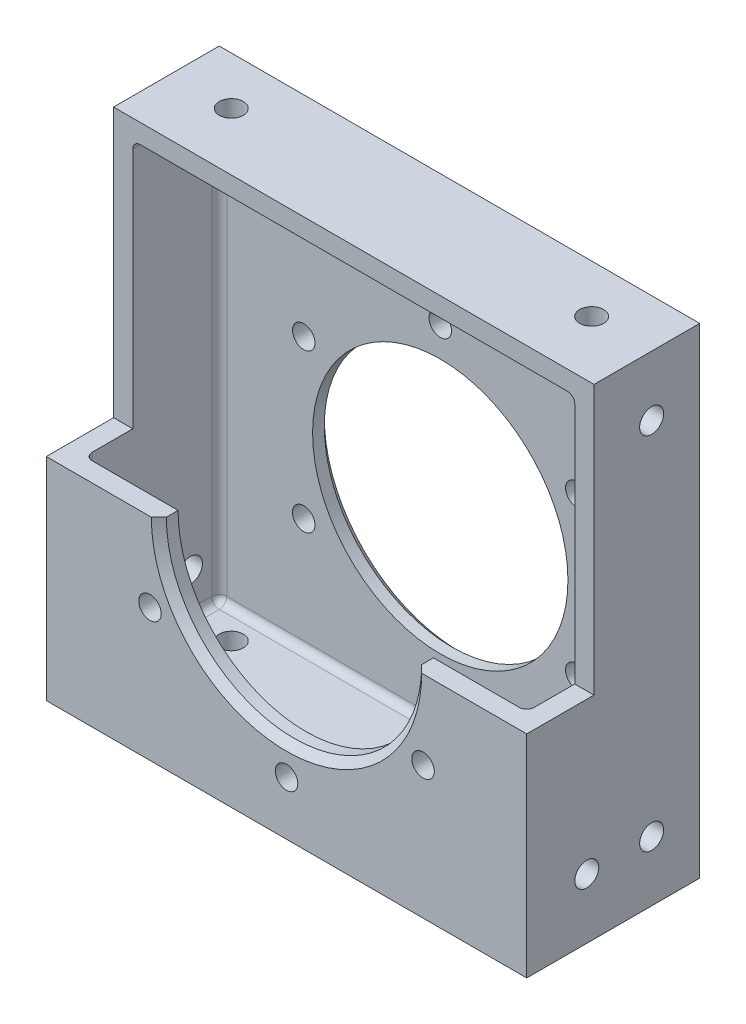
from build123d import *

# Parameters (mm, degrees)
BASE_EXTRUDE_DEPTH = 50.8
SHELL1_T           = -2.032
SKETCH7_R          = 13.5001
CUT_EXTRUDE1_DEPTH = 75.133197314
SKETCH8_R          = 1.27
CUT_EXTRUDE2_DEPTH = 75.133197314
SKETCH9_R          = 1.27
CUT_EXTRUDE3_DEPTH = 75.133197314
SKETCH10_R         = 1.190625
CUT_EXTRUDE4_DEPTH = 75.133197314
CIRPATTERN1_COUNT  = 6
FILLET1_R          = 0.79375
FILLET2_R          = 0.79375
CHAMFER1_SIZE      = 0.79375


with BuildPart() as part:
    # Sketch6 → Base-Extrude (new body)
    with BuildSketch(Plane(origin=(0, 59.342935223, 0), x_dir=(0, 0, -1), z_dir=(1, 0, 0))):
        Polygon((7.112, -8.542935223), (18.288, -8.542935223), (18.288, -59.342935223), (0, -59.342935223), (0, -36.990935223), (7.112, -36.990935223), align=None)
    extrude(amount=-BASE_EXTRUDE_DEPTH)

    # Shell1
    shell1_openings = [part.faces().sort_by_distance(p)[0] for p in [
        (-25.4, 22.352, -3.556),
        (-25.4, 36.576, -7.112),
    ]]
    offset(amount=SHELL1_T, openings=shell1_openings, kind=Kind.INTERSECTION)

    # Sketch7 → Cut-Extrude1 (cut, through all)
    with BuildSketch(Plane.XY):
        with Locations((-25.4, 22.352)):
            Circle(SKETCH7_R)
    extrude(amount=-CUT_EXTRUDE1_DEPTH, mode=Mode.SUBTRACT)

    # Sketch8 → Cut-Extrude2 (cut, through all)
    with BuildSketch(Plane(origin=(0, 0, 0), x_dir=(0, 0, -1), z_dir=(1, 0, 0))):
        with Locations((13.208, 44.45)):
            Circle(SKETCH8_R)
        with Locations((13.208, 6.35)):
            Circle(SKETCH8_R)
        with Locations((6.35, 6.35)):
            Circle(SKETCH8_R)
    extrude(amount=-CUT_EXTRUDE2_DEPTH, mode=Mode.SUBTRACT)

    # Sketch9 → Cut-Extrude3 (cut, through all)
    with BuildSketch(Plane(origin=(0, 50.8, 0), x_dir=(-1, 0, 0), z_dir=(0, 1, 0))):
        with Locations(Location((44.45, -13.208, 0), (0, 0, 90))):
            Circle(SKETCH9_R)
        with Locations(Location((6.35, -13.208, 0), (0, 0, 90))):
            Circle(SKETCH9_R)
    extrude(amount=-CUT_EXTRUDE3_DEPTH, mode=Mode.SUBTRACT)

    # Sketch10 → Cut-Extrude4 (cut, through all)
    with BuildSketch(Plane(origin=(0, 0, -18.288), x_dir=(-1, 0, 0), z_dir=(0, 0, -1))):
        with Locations((25.4, 5.68325)):
            Circle(SKETCH10_R)
    cut_extrude4 = extrude(amount=-CUT_EXTRUDE4_DEPTH, mode=Mode.SUBTRACT)

    # CirPattern1: Cut-Extrude4 ×6 about axis
    cirpattern1_axis = Axis((-25.4, 22.352, 0), (0, 0, 1))
    for i in range(1, CIRPATTERN1_COUNT):
        add(cut_extrude4.rotate(cirpattern1_axis, i * 360 / CIRPATTERN1_COUNT), mode=Mode.SUBTRACT)

    # Fillet1
    fillet1_edges = [part.edges().sort_by_distance(p)[0] for p in [
        (-48.768, 25.4, -16.256),
        (-48.768, 12.192, -2.032),
        (-2.032, 12.192, -2.032),
        (-2.032, 25.4, -16.256),
    ]]
    fillet(fillet1_edges, radius=FILLET1_R)

    # Fillet2
    fillet2_edges = [part.edges().sort_by_distance(p)[0] for p in [
        (-48.768, 2.032, -9.144),
        (-48.768, 48.768, -11.287125),
        (-2.032, 48.768, -11.287125),
        (-25.4, 48.768, -16.256),
        (-2.264483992, 48.768, -16.023516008),
        (-48.535516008, 48.768, -16.023516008),
        (-25.4, 2.032, -16.256),
        (-2.032, 2.032, -9.144),
        (-25.4, 2.032, -2.032),
        (-48.535516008, 2.032, -2.264483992),
        (-2.264483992, 2.032, -2.264483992),
        (-2.264483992, 2.032, -16.023516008),
        (-48.535516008, 2.032, -16.023516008),
    ]]
    fillet(fillet2_edges, radius=FILLET2_R)

    # Chamfer1
    chamfer1_edges = [part.edges().sort_by_distance(p)[0] for p in [
        (-38.9001, 22.352, -18.288),
        (-25.4, 8.8519, 0),
    ]]
    chamfer(chamfer1_edges, length=CHAMFER1_SIZE)


solid = part.part
